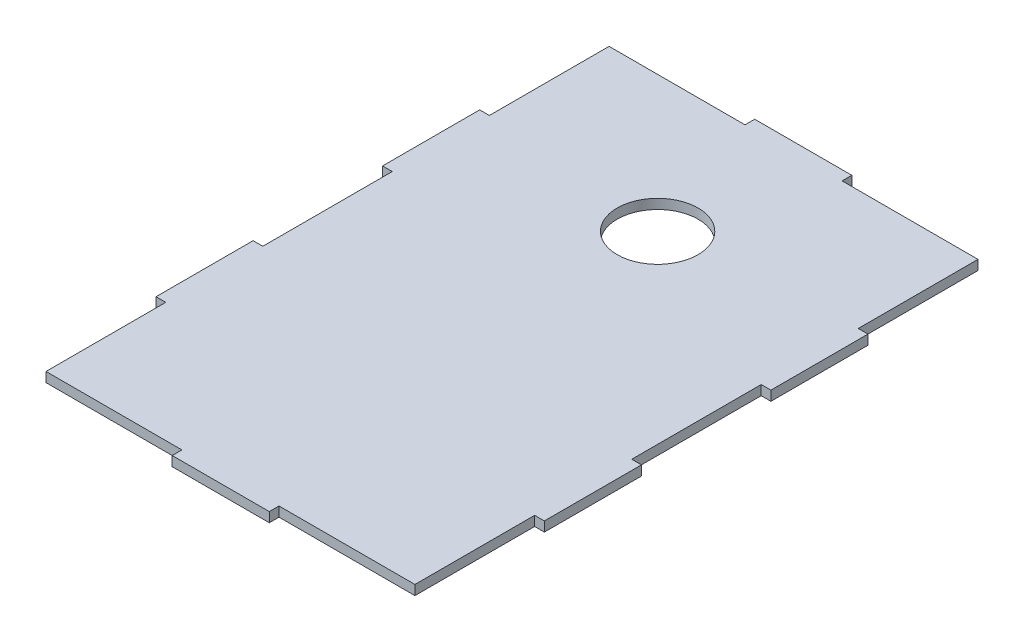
from build123d import *

# Parameters (mm, degrees)
SKETCH1_W           = 120
SKETCH1_H           = 180
BOSS_EXTRUDE1_DEPTH = 3
SKETCH3_W           = 3
SKETCH3_H           = 40
CUT_EXTRUDE2_DEPTH  = 10
SKETCH4_W           = 42
SKETCH4_H           = 3
CUT_EXTRUDE3_DEPTH  = 10
SKETCH8_R           = 12.5
CUT_EXTRUDE7_DEPTH  = 10


with BuildPart() as part:
    # Sketch1 → Boss-Extrude1 (new body)
    with BuildSketch(Plane(origin=(0, 0, 0), x_dir=(1, 0, 0), z_dir=(0, 1, 0))):
        Rectangle(SKETCH1_W, SKETCH1_H)
    extrude(amount=BOSS_EXTRUDE1_DEPTH)

    # Sketch3 → Cut-Extrude2 (cut)
    with BuildSketch(Plane(origin=(0, 3, 0), x_dir=(1, 0, 0), z_dir=(0, 1, 0))):
        with Locations((-58.5, 70)):
            Rectangle(SKETCH3_W, SKETCH3_H)
        with Locations((-58.5, -70)):
            Rectangle(SKETCH3_W, SKETCH3_H)
        with Locations((-58.5, 0)):
            Rectangle(SKETCH3_W, SKETCH3_H)
    cut_extrude2 = extrude(amount=-CUT_EXTRUDE2_DEPTH, mode=Mode.SUBTRACT)

    # Mirror1: Cut-Extrude2 across plane
    add(cut_extrude2.mirror(Plane(origin=(0, 0, 0), x_dir=(0, 0, 1), z_dir=(1, 0, 0))), mode=Mode.SUBTRACT)

    # Sketch4 → Cut-Extrude3 (cut)
    with BuildSketch(Plane(origin=(0, 3, 0), x_dir=(1, 0, 0), z_dir=(0, 1, 0))):
        with Locations((-36, -88.5)):
            Rectangle(SKETCH4_W, SKETCH4_H)
        with Locations((36, -88.5)):
            Rectangle(SKETCH4_W, SKETCH4_H)
    cut_extrude3 = extrude(amount=-CUT_EXTRUDE3_DEPTH, mode=Mode.SUBTRACT)

    # Mirror2: Cut-Extrude3 across plane
    add(cut_extrude3.mirror(Plane.XY), mode=Mode.SUBTRACT)

    # Sketch8 → Cut-Extrude7 (cut)
    with BuildSketch(Plane(origin=(0, 3, 0), x_dir=(1, 0, 0), z_dir=(0, 1, 0))):
        with Locations(Location((0, 45, 0), (0, 0, 270))):
            Circle(SKETCH8_R)
    extrude(amount=-CUT_EXTRUDE7_DEPTH, mode=Mode.SUBTRACT)


solid = part.part
